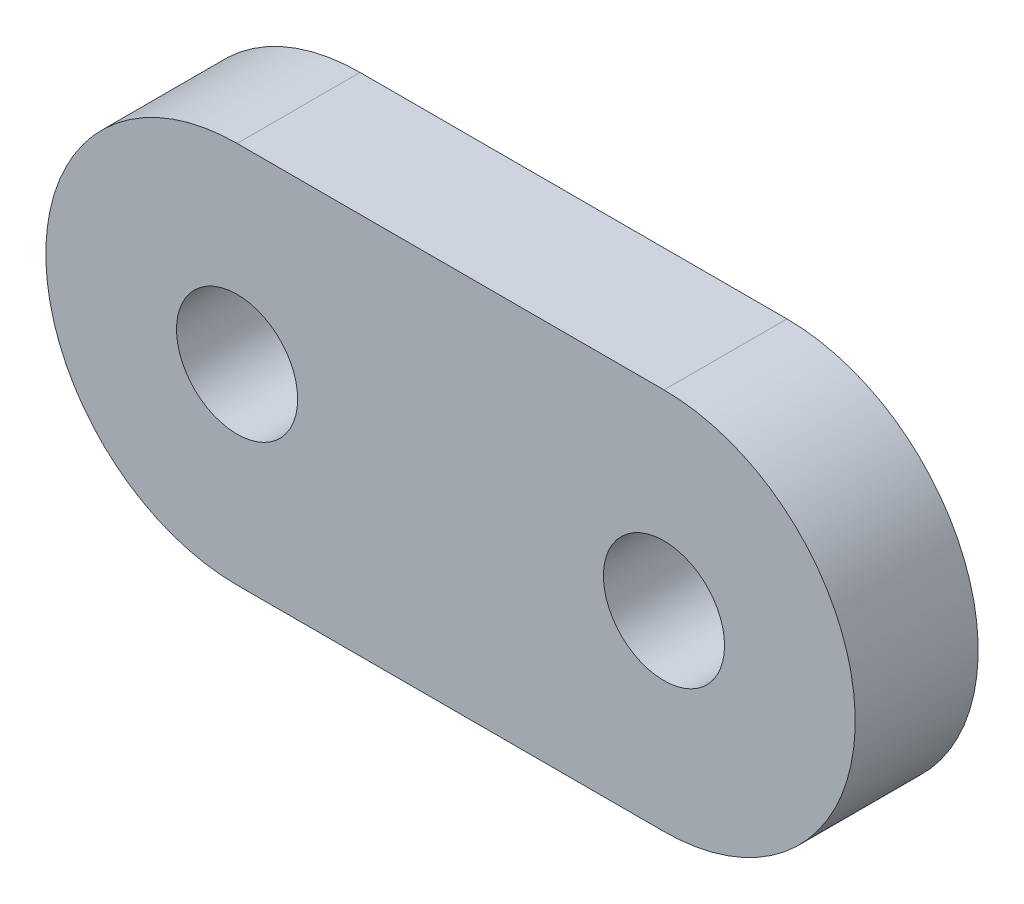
ISO-10303-21;
HEADER;
FILE_DESCRIPTION(('STEP AP214'),'2;1');
FILE_NAME('part.step','',(''),(''),'','','');
FILE_SCHEMA(('AUTOMOTIVE_DESIGN { 1 0 10303 214 1 1 1 1 }'));
ENDSEC;
DATA;
#1=APPLICATION_CONTEXT('core data for automotive mechanical design processes');
#2=APPLICATION_PROTOCOL_DEFINITION('international standard','automotive_design',2000,#1);
#3=PRODUCT_CONTEXT('',#1,'mechanical');
#4=PRODUCT('Part','Part','',(#3));
#5=PRODUCT_RELATED_PRODUCT_CATEGORY('part','',(#4));
#6=PRODUCT_DEFINITION_FORMATION('','',#4);
#7=PRODUCT_DEFINITION_CONTEXT('part definition',#1,'design');
#8=PRODUCT_DEFINITION('design','',#6,#7);
#9=PRODUCT_DEFINITION_SHAPE('','',#8);
#10=(LENGTH_UNIT() NAMED_UNIT(*) SI_UNIT(.MILLI.,.METRE.));
#11=(NAMED_UNIT(*) PLANE_ANGLE_UNIT() SI_UNIT($,.RADIAN.));
#12=(NAMED_UNIT(*) SI_UNIT($,.STERADIAN.) SOLID_ANGLE_UNIT());
#13=UNCERTAINTY_MEASURE_WITH_UNIT(LENGTH_MEASURE(1.E-05),#10,'distance_accuracy_value','');
#14=(GEOMETRIC_REPRESENTATION_CONTEXT(3) GLOBAL_UNCERTAINTY_ASSIGNED_CONTEXT((#13)) GLOBAL_UNIT_ASSIGNED_CONTEXT((#10,
#11,#12)) REPRESENTATION_CONTEXT('',''));
#15=CARTESIAN_POINT('',(0.,0.,0.));
#16=DIRECTION('',(0.,0.,1.));
#17=DIRECTION('',(1.,0.,0.));
#18=AXIS2_PLACEMENT_3D('',#15,#16,#17);
#19=CARTESIAN_POINT('',(0.,-10.668,-2.286));
#20=DIRECTION('',(0.,1.,0.));
#21=DIRECTION('',(-1.,0.,0.));
#22=AXIS2_PLACEMENT_3D('',#19,#20,#21);
#23=PLANE('',#22);
#24=DIRECTION('',(-1.,0.,0.));
#25=VECTOR('',#24,1.);
#26=CARTESIAN_POINT('',(0.,-10.668,4.572));
#27=LINE('',#26,#25);
#28=CARTESIAN_POINT('',(7.9375,-10.668,4.572));
#29=VERTEX_POINT('',#28);
#30=CARTESIAN_POINT('',(-15.875,-10.668,4.572));
#31=VERTEX_POINT('',#30);
#32=EDGE_CURVE('E87',#29,#31,#27,.T.);
#33=ORIENTED_EDGE('',*,*,#32,.T.);
#34=DIRECTION('',(0.,0.,1.));
#35=VECTOR('',#34,1.);
#36=CARTESIAN_POINT('',(-15.875,-10.668,-2.286));
#37=LINE('',#36,#35);
#38=CARTESIAN_POINT('',(-15.875,-10.668,-2.286));
#39=VERTEX_POINT('',#38);
#40=EDGE_CURVE('E10',#39,#31,#37,.T.);
#41=ORIENTED_EDGE('',*,*,#40,.F.);
#42=DIRECTION('',(-1.,0.,0.));
#43=VECTOR('',#42,1.);
#44=CARTESIAN_POINT('',(0.,-10.668,-2.286));
#45=LINE('',#44,#43);
#46=CARTESIAN_POINT('',(7.9375,-10.668,-2.286));
#47=VERTEX_POINT('',#46);
#48=EDGE_CURVE('E35',#47,#39,#45,.T.);
#49=ORIENTED_EDGE('',*,*,#48,.F.);
#50=DIRECTION('',(0.,0.,1.));
#51=VECTOR('',#50,1.);
#52=CARTESIAN_POINT('',(7.9375,-10.668,-2.286));
#53=LINE('',#52,#51);
#54=EDGE_CURVE('E20',#47,#29,#53,.T.);
#55=ORIENTED_EDGE('',*,*,#54,.T.);
#56=EDGE_LOOP('',(#33,#41,#49,#55));
#57=FACE_BOUND('',#56,.T.);
#58=ADVANCED_FACE('F16',(#57),#23,.F.);
#59=CARTESIAN_POINT('',(-15.875,0.,-2.286));
#60=DIRECTION('',(0.,0.,1.));
#61=DIRECTION('',(1.,0.,0.));
#62=AXIS2_PLACEMENT_3D('',#59,#60,#61);
#63=CYLINDRICAL_SURFACE('',#62,10.668);
#64=CARTESIAN_POINT('',(-15.875,0.,4.572));
#65=DIRECTION('',(0.,0.,1.));
#66=DIRECTION('',(1.,0.,0.));
#67=AXIS2_PLACEMENT_3D('',#64,#65,#66);
#68=CIRCLE('',#67,10.668);
#69=CARTESIAN_POINT('',(-15.875,10.668,4.572));
#70=VERTEX_POINT('',#69);
#71=EDGE_CURVE('E92',#70,#31,#68,.T.);
#72=ORIENTED_EDGE('',*,*,#71,.F.);
#73=DIRECTION('',(0.,0.,1.));
#74=VECTOR('',#73,1.);
#75=CARTESIAN_POINT('',(-15.875,10.668,-2.286));
#76=LINE('',#75,#74);
#77=CARTESIAN_POINT('',(-15.875,10.668,-2.286));
#78=VERTEX_POINT('',#77);
#79=EDGE_CURVE('E26',#78,#70,#76,.T.);
#80=ORIENTED_EDGE('',*,*,#79,.F.);
#81=CARTESIAN_POINT('',(-15.875,0.,-2.286));
#82=DIRECTION('',(0.,0.,1.));
#83=DIRECTION('',(1.,0.,0.));
#84=AXIS2_PLACEMENT_3D('',#81,#82,#83);
#85=CIRCLE('',#84,10.668);
#86=EDGE_CURVE('E72',#78,#39,#85,.T.);
#87=ORIENTED_EDGE('',*,*,#86,.T.);
#88=ORIENTED_EDGE('',*,*,#40,.T.);
#89=EDGE_LOOP('',(#72,#80,#87,#88));
#90=FACE_BOUND('',#89,.T.);
#91=ADVANCED_FACE('F120',(#90),#63,.T.);
#92=CARTESIAN_POINT('',(0.,10.668,-2.286));
#93=DIRECTION('',(0.,1.,0.));
#94=DIRECTION('',(-1.,0.,0.));
#95=AXIS2_PLACEMENT_3D('',#92,#93,#94);
#96=PLANE('',#95);
#97=DIRECTION('',(-1.,0.,0.));
#98=VECTOR('',#97,1.);
#99=CARTESIAN_POINT('',(0.,10.668,4.572));
#100=LINE('',#99,#98);
#101=CARTESIAN_POINT('',(7.9375,10.668,4.572));
#102=VERTEX_POINT('',#101);
#103=EDGE_CURVE('E68',#102,#70,#100,.T.);
#104=ORIENTED_EDGE('',*,*,#103,.F.);
#105=DIRECTION('',(0.,0.,1.));
#106=VECTOR('',#105,1.);
#107=CARTESIAN_POINT('',(7.9375,10.668,-2.286));
#108=LINE('',#107,#106);
#109=CARTESIAN_POINT('',(7.9375,10.668,-2.286));
#110=VERTEX_POINT('',#109);
#111=EDGE_CURVE('E64',#110,#102,#108,.T.);
#112=ORIENTED_EDGE('',*,*,#111,.F.);
#113=DIRECTION('',(-1.,0.,0.));
#114=VECTOR('',#113,1.);
#115=CARTESIAN_POINT('',(0.,10.668,-2.286));
#116=LINE('',#115,#114);
#117=EDGE_CURVE('E67',#110,#78,#116,.T.);
#118=ORIENTED_EDGE('',*,*,#117,.T.);
#119=ORIENTED_EDGE('',*,*,#79,.T.);
#120=EDGE_LOOP('',(#104,#112,#118,#119));
#121=FACE_BOUND('',#120,.T.);
#122=ADVANCED_FACE('F66',(#121),#96,.T.);
#123=CARTESIAN_POINT('',(-15.875,0.,-2.286));
#124=DIRECTION('',(0.,0.,1.));
#125=DIRECTION('',(1.,0.,0.));
#126=AXIS2_PLACEMENT_3D('',#123,#124,#125);
#127=CYLINDRICAL_SURFACE('',#126,3.3782);
#128=CARTESIAN_POINT('',(-15.875,0.,-2.286));
#129=DIRECTION('',(0.,0.,1.));
#130=DIRECTION('',(1.,0.,0.));
#131=AXIS2_PLACEMENT_3D('',#128,#129,#130);
#132=CIRCLE('',#131,3.3782);
#133=CARTESIAN_POINT('',(-12.4968,0.,-2.286));
#134=VERTEX_POINT('',#133);
#135=EDGE_CURVE('E76',#134,#134,#132,.F.);
#136=ORIENTED_EDGE('',*,*,#135,.T.);
#137=EDGE_LOOP('',(#136));
#138=FACE_BOUND('',#137,.T.);
#139=CARTESIAN_POINT('',(-15.875,0.,4.572));
#140=DIRECTION('',(0.,0.,1.));
#141=DIRECTION('',(1.,0.,0.));
#142=AXIS2_PLACEMENT_3D('',#139,#140,#141);
#143=CIRCLE('',#142,3.3782);
#144=CARTESIAN_POINT('',(-12.4968,0.,4.572));
#145=VERTEX_POINT('',#144);
#146=EDGE_CURVE('E84',#145,#145,#143,.F.);
#147=ORIENTED_EDGE('',*,*,#146,.F.);
#148=EDGE_LOOP('',(#147));
#149=FACE_BOUND('',#148,.T.);
#150=ADVANCED_FACE('F105',(#138,#149),#127,.F.);
#151=CARTESIAN_POINT('',(7.9375,0.,-2.286));
#152=DIRECTION('',(0.,0.,1.));
#153=DIRECTION('',(1.,0.,0.));
#154=AXIS2_PLACEMENT_3D('',#151,#152,#153);
#155=CYLINDRICAL_SURFACE('',#154,3.3782);
#156=CARTESIAN_POINT('',(7.9375,0.,-2.286));
#157=DIRECTION('',(0.,0.,1.));
#158=DIRECTION('',(1.,0.,0.));
#159=AXIS2_PLACEMENT_3D('',#156,#157,#158);
#160=CIRCLE('',#159,3.3782);
#161=CARTESIAN_POINT('',(11.3157,0.,-2.286));
#162=VERTEX_POINT('',#161);
#163=EDGE_CURVE('E94',#162,#162,#160,.T.);
#164=ORIENTED_EDGE('',*,*,#163,.F.);
#165=EDGE_LOOP('',(#164));
#166=FACE_BOUND('',#165,.T.);
#167=CARTESIAN_POINT('',(7.9375,0.,4.572));
#168=DIRECTION('',(0.,0.,1.));
#169=DIRECTION('',(1.,0.,0.));
#170=AXIS2_PLACEMENT_3D('',#167,#168,#169);
#171=CIRCLE('',#170,3.3782);
#172=CARTESIAN_POINT('',(11.3157,0.,4.572));
#173=VERTEX_POINT('',#172);
#174=EDGE_CURVE('E81',#173,#173,#171,.T.);
#175=ORIENTED_EDGE('',*,*,#174,.T.);
#176=EDGE_LOOP('',(#175));
#177=FACE_BOUND('',#176,.T.);
#178=ADVANCED_FACE('F18',(#166,#177),#155,.F.);
#179=CARTESIAN_POINT('',(7.9375,0.,-2.286));
#180=DIRECTION('',(0.,0.,1.));
#181=DIRECTION('',(1.,0.,0.));
#182=AXIS2_PLACEMENT_3D('',#179,#180,#181);
#183=CYLINDRICAL_SURFACE('',#182,10.668);
#184=CARTESIAN_POINT('',(7.9375,0.,4.572));
#185=DIRECTION('',(0.,0.,1.));
#186=DIRECTION('',(1.,0.,0.));
#187=AXIS2_PLACEMENT_3D('',#184,#185,#186);
#188=CIRCLE('',#187,10.668);
#189=EDGE_CURVE('E89',#29,#102,#188,.T.);
#190=ORIENTED_EDGE('',*,*,#189,.F.);
#191=ORIENTED_EDGE('',*,*,#54,.F.);
#192=CARTESIAN_POINT('',(7.9375,0.,-2.286));
#193=DIRECTION('',(0.,0.,1.));
#194=DIRECTION('',(1.,0.,0.));
#195=AXIS2_PLACEMENT_3D('',#192,#193,#194);
#196=CIRCLE('',#195,10.668);
#197=EDGE_CURVE('E71',#47,#110,#196,.T.);
#198=ORIENTED_EDGE('',*,*,#197,.T.);
#199=ORIENTED_EDGE('',*,*,#111,.T.);
#200=EDGE_LOOP('',(#190,#191,#198,#199));
#201=FACE_BOUND('',#200,.T.);
#202=ADVANCED_FACE('F74',(#201),#183,.T.);
#203=CARTESIAN_POINT('',(0.,0.,-2.286));
#204=DIRECTION('',(0.,0.,1.));
#205=DIRECTION('',(1.,0.,0.));
#206=AXIS2_PLACEMENT_3D('',#203,#204,#205);
#207=PLANE('',#206);
#208=ORIENTED_EDGE('',*,*,#163,.T.);
#209=EDGE_LOOP('',(#208));
#210=FACE_BOUND('',#209,.T.);
#211=ORIENTED_EDGE('',*,*,#135,.F.);
#212=EDGE_LOOP('',(#211));
#213=FACE_BOUND('',#212,.T.);
#214=ORIENTED_EDGE('',*,*,#48,.T.);
#215=ORIENTED_EDGE('',*,*,#86,.F.);
#216=ORIENTED_EDGE('',*,*,#117,.F.);
#217=ORIENTED_EDGE('',*,*,#197,.F.);
#218=EDGE_LOOP('',(#214,#215,#216,#217));
#219=FACE_BOUND('',#218,.T.);
#220=ADVANCED_FACE('F70',(#210,#213,#219),#207,.F.);
#221=CARTESIAN_POINT('',(0.,0.,4.572));
#222=DIRECTION('',(0.,0.,1.));
#223=DIRECTION('',(1.,0.,0.));
#224=AXIS2_PLACEMENT_3D('',#221,#222,#223);
#225=PLANE('',#224);
#226=ORIENTED_EDGE('',*,*,#174,.F.);
#227=EDGE_LOOP('',(#226));
#228=FACE_BOUND('',#227,.T.);
#229=ORIENTED_EDGE('',*,*,#146,.T.);
#230=EDGE_LOOP('',(#229));
#231=FACE_BOUND('',#230,.T.);
#232=ORIENTED_EDGE('',*,*,#32,.F.);
#233=ORIENTED_EDGE('',*,*,#189,.T.);
#234=ORIENTED_EDGE('',*,*,#103,.T.);
#235=ORIENTED_EDGE('',*,*,#71,.T.);
#236=EDGE_LOOP('',(#232,#233,#234,#235));
#237=FACE_BOUND('',#236,.T.);
#238=ADVANCED_FACE('F109',(#228,#231,#237),#225,.T.);
#239=CLOSED_SHELL('',(#58,#91,#122,#150,#178,#202,#220,#238));
#240=MANIFOLD_SOLID_BREP('B1',#239);
#241=ADVANCED_BREP_SHAPE_REPRESENTATION('',(#18,#240),#14);
#242=SHAPE_DEFINITION_REPRESENTATION(#9,#241);
ENDSEC;
END-ISO-10303-21;
